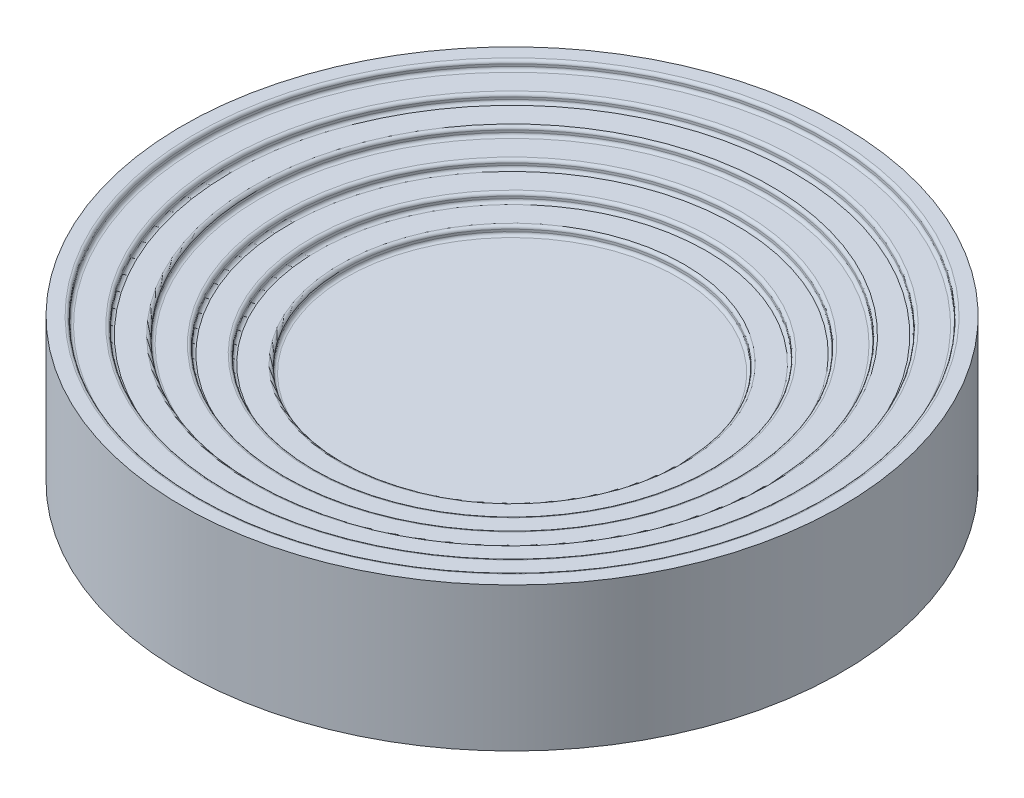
ISO-10303-21;
HEADER;
FILE_DESCRIPTION(('STEP AP214'),'2;1');
FILE_NAME('part.step','',(''),(''),'','','');
FILE_SCHEMA(('AUTOMOTIVE_DESIGN { 1 0 10303 214 1 1 1 1 }'));
ENDSEC;
DATA;
#1=APPLICATION_CONTEXT('core data for automotive mechanical design processes');
#2=APPLICATION_PROTOCOL_DEFINITION('international standard','automotive_design',2000,#1);
#3=PRODUCT_CONTEXT('',#1,'mechanical');
#4=PRODUCT('Part','Part','',(#3));
#5=PRODUCT_RELATED_PRODUCT_CATEGORY('part','',(#4));
#6=PRODUCT_DEFINITION_FORMATION('','',#4);
#7=PRODUCT_DEFINITION_CONTEXT('part definition',#1,'design');
#8=PRODUCT_DEFINITION('design','',#6,#7);
#9=PRODUCT_DEFINITION_SHAPE('','',#8);
#10=(LENGTH_UNIT() NAMED_UNIT(*) SI_UNIT(.MILLI.,.METRE.));
#11=(NAMED_UNIT(*) PLANE_ANGLE_UNIT() SI_UNIT($,.RADIAN.));
#12=(NAMED_UNIT(*) SI_UNIT($,.STERADIAN.) SOLID_ANGLE_UNIT());
#13=UNCERTAINTY_MEASURE_WITH_UNIT(LENGTH_MEASURE(1.E-05),#10,'distance_accuracy_value','');
#14=(GEOMETRIC_REPRESENTATION_CONTEXT(3) GLOBAL_UNCERTAINTY_ASSIGNED_CONTEXT((#13)) GLOBAL_UNIT_ASSIGNED_CONTEXT((#10,
#11,#12)) REPRESENTATION_CONTEXT('',''));
#15=CARTESIAN_POINT('',(0.,0.,0.));
#16=DIRECTION('',(0.,0.,1.));
#17=DIRECTION('',(1.,0.,0.));
#18=AXIS2_PLACEMENT_3D('',#15,#16,#17);
#19=CARTESIAN_POINT('',(0.,31.5,0.));
#20=DIRECTION('',(0.,1.,0.));
#21=DIRECTION('',(0.,0.,1.));
#22=AXIS2_PLACEMENT_3D('',#19,#20,#21);
#23=PLANE('',#22);
#24=CARTESIAN_POINT('',(0.,31.5,0.));
#25=DIRECTION('',(0.,1.,0.));
#26=DIRECTION('',(0.,0.,1.));
#27=AXIS2_PLACEMENT_3D('',#24,#25,#26);
#28=CIRCLE('',#27,55.375);
#29=CARTESIAN_POINT('',(0.,31.5,55.375));
#30=VERTEX_POINT('',#29);
#31=EDGE_CURVE('E108',#30,#30,#28,.T.);
#32=ORIENTED_EDGE('',*,*,#31,.T.);
#33=EDGE_LOOP('',(#32));
#34=FACE_BOUND('',#33,.T.);
#35=ADVANCED_FACE('F37',(#34),#23,.T.);
#36=CARTESIAN_POINT('',(0.,0.,0.));
#37=DIRECTION('',(0.,-1.,0.));
#38=DIRECTION('',(0.,0.,-1.));
#39=AXIS2_PLACEMENT_3D('',#36,#37,#38);
#40=CYLINDRICAL_SURFACE('',#39,56.375);
#41=CARTESIAN_POINT('',(0.,32.5,0.));
#42=DIRECTION('',(0.,1.,0.));
#43=DIRECTION('',(0.,0.,1.));
#44=AXIS2_PLACEMENT_3D('',#41,#42,#43);
#45=CIRCLE('',#44,56.375);
#46=CARTESIAN_POINT('',(0.,32.5,56.375));
#47=VERTEX_POINT('',#46);
#48=EDGE_CURVE('E111',#47,#47,#45,.F.);
#49=ORIENTED_EDGE('',*,*,#48,.T.);
#50=EDGE_LOOP('',(#49));
#51=FACE_BOUND('',#50,.T.);
#52=CARTESIAN_POINT('',(0.,33.25,0.));
#53=DIRECTION('',(0.,1.,0.));
#54=DIRECTION('',(0.,0.,1.));
#55=AXIS2_PLACEMENT_3D('',#52,#53,#54);
#56=CIRCLE('',#55,56.375);
#57=CARTESIAN_POINT('',(0.,33.25,56.375));
#58=VERTEX_POINT('',#57);
#59=EDGE_CURVE('E114',#58,#58,#56,.T.);
#60=ORIENTED_EDGE('',*,*,#59,.T.);
#61=EDGE_LOOP('',(#60));
#62=FACE_BOUND('',#61,.T.);
#63=ADVANCED_FACE('F156',(#51,#62),#40,.F.);
#64=CARTESIAN_POINT('',(56.375,34.25,0.));
#65=DIRECTION('',(0.,1.,0.));
#66=DIRECTION('',(0.,0.,1.));
#67=AXIS2_PLACEMENT_3D('',#64,#65,#66);
#68=PLANE('',#67);
#69=CARTESIAN_POINT('',(0.,34.25,0.));
#70=DIRECTION('',(0.,1.,0.));
#71=DIRECTION('',(0.,0.,1.));
#72=AXIS2_PLACEMENT_3D('',#69,#70,#71);
#73=CIRCLE('',#72,57.375);
#74=CARTESIAN_POINT('',(0.,34.25,57.375));
#75=VERTEX_POINT('',#74);
#76=EDGE_CURVE('E102',#75,#75,#73,.F.);
#77=ORIENTED_EDGE('',*,*,#76,.T.);
#78=EDGE_LOOP('',(#77));
#79=FACE_BOUND('',#78,.T.);
#80=CARTESIAN_POINT('',(0.,34.25,0.));
#81=DIRECTION('',(0.,1.,0.));
#82=DIRECTION('',(0.,0.,1.));
#83=AXIS2_PLACEMENT_3D('',#80,#81,#82);
#84=CIRCLE('',#83,65.);
#85=CARTESIAN_POINT('',(0.,34.25,65.));
#86=VERTEX_POINT('',#85);
#87=EDGE_CURVE('E105',#86,#86,#84,.T.);
#88=ORIENTED_EDGE('',*,*,#87,.T.);
#89=EDGE_LOOP('',(#88));
#90=FACE_BOUND('',#89,.T.);
#91=ADVANCED_FACE('F162',(#79,#90),#68,.T.);
#92=CARTESIAN_POINT('',(0.,0.,0.));
#93=DIRECTION('',(0.,-1.,0.));
#94=DIRECTION('',(0.,0.,-1.));
#95=AXIS2_PLACEMENT_3D('',#92,#93,#94);
#96=CYLINDRICAL_SURFACE('',#95,66.);
#97=CARTESIAN_POINT('',(0.,35.25,0.));
#98=DIRECTION('',(0.,1.,0.));
#99=DIRECTION('',(0.,0.,1.));
#100=AXIS2_PLACEMENT_3D('',#97,#98,#99);
#101=CIRCLE('',#100,66.);
#102=CARTESIAN_POINT('',(0.,35.25,66.));
#103=VERTEX_POINT('',#102);
#104=EDGE_CURVE('E96',#103,#103,#101,.F.);
#105=ORIENTED_EDGE('',*,*,#104,.T.);
#106=EDGE_LOOP('',(#105));
#107=FACE_BOUND('',#106,.T.);
#108=CARTESIAN_POINT('',(0.,36.,0.));
#109=DIRECTION('',(0.,1.,0.));
#110=DIRECTION('',(0.,0.,1.));
#111=AXIS2_PLACEMENT_3D('',#108,#109,#110);
#112=CIRCLE('',#111,66.);
#113=CARTESIAN_POINT('',(0.,36.,66.));
#114=VERTEX_POINT('',#113);
#115=EDGE_CURVE('E99',#114,#114,#112,.T.);
#116=ORIENTED_EDGE('',*,*,#115,.T.);
#117=EDGE_LOOP('',(#116));
#118=FACE_BOUND('',#117,.T.);
#119=ADVANCED_FACE('F247',(#107,#118),#96,.F.);
#120=CARTESIAN_POINT('',(66.,37.,0.));
#121=DIRECTION('',(0.,1.,0.));
#122=DIRECTION('',(0.,0.,1.));
#123=AXIS2_PLACEMENT_3D('',#120,#121,#122);
#124=PLANE('',#123);
#125=CARTESIAN_POINT('',(0.,37.,0.));
#126=DIRECTION('',(0.,1.,0.));
#127=DIRECTION('',(0.,0.,1.));
#128=AXIS2_PLACEMENT_3D('',#125,#126,#127);
#129=CIRCLE('',#128,67.);
#130=CARTESIAN_POINT('',(0.,37.,67.));
#131=VERTEX_POINT('',#130);
#132=EDGE_CURVE('E90',#131,#131,#129,.F.);
#133=ORIENTED_EDGE('',*,*,#132,.T.);
#134=EDGE_LOOP('',(#133));
#135=FACE_BOUND('',#134,.T.);
#136=CARTESIAN_POINT('',(0.,37.,0.));
#137=DIRECTION('',(0.,1.,0.));
#138=DIRECTION('',(0.,0.,1.));
#139=AXIS2_PLACEMENT_3D('',#136,#137,#138);
#140=CIRCLE('',#139,74.625);
#141=CARTESIAN_POINT('',(0.,37.,74.625));
#142=VERTEX_POINT('',#141);
#143=EDGE_CURVE('E93',#142,#142,#140,.T.);
#144=ORIENTED_EDGE('',*,*,#143,.T.);
#145=EDGE_LOOP('',(#144));
#146=FACE_BOUND('',#145,.T.);
#147=ADVANCED_FACE('F243',(#135,#146),#124,.T.);
#148=CARTESIAN_POINT('',(0.,0.,0.));
#149=DIRECTION('',(0.,-1.,0.));
#150=DIRECTION('',(0.,0.,-1.));
#151=AXIS2_PLACEMENT_3D('',#148,#149,#150);
#152=CYLINDRICAL_SURFACE('',#151,75.625);
#153=CARTESIAN_POINT('',(0.,38.,0.));
#154=DIRECTION('',(0.,1.,0.));
#155=DIRECTION('',(0.,0.,1.));
#156=AXIS2_PLACEMENT_3D('',#153,#154,#155);
#157=CIRCLE('',#156,75.625);
#158=CARTESIAN_POINT('',(0.,38.,75.625));
#159=VERTEX_POINT('',#158);
#160=EDGE_CURVE('E84',#159,#159,#157,.F.);
#161=ORIENTED_EDGE('',*,*,#160,.T.);
#162=EDGE_LOOP('',(#161));
#163=FACE_BOUND('',#162,.T.);
#164=CARTESIAN_POINT('',(0.,38.75,0.));
#165=DIRECTION('',(0.,1.,0.));
#166=DIRECTION('',(0.,0.,1.));
#167=AXIS2_PLACEMENT_3D('',#164,#165,#166);
#168=CIRCLE('',#167,75.625);
#169=CARTESIAN_POINT('',(0.,38.75,75.625));
#170=VERTEX_POINT('',#169);
#171=EDGE_CURVE('E87',#170,#170,#168,.T.);
#172=ORIENTED_EDGE('',*,*,#171,.T.);
#173=EDGE_LOOP('',(#172));
#174=FACE_BOUND('',#173,.T.);
#175=ADVANCED_FACE('F239',(#163,#174),#152,.F.);
#176=CARTESIAN_POINT('',(75.625,39.75,0.));
#177=DIRECTION('',(0.,1.,0.));
#178=DIRECTION('',(0.,0.,1.));
#179=AXIS2_PLACEMENT_3D('',#176,#177,#178);
#180=PLANE('',#179);
#181=CARTESIAN_POINT('',(0.,39.75,0.));
#182=DIRECTION('',(0.,1.,0.));
#183=DIRECTION('',(0.,0.,1.));
#184=AXIS2_PLACEMENT_3D('',#181,#182,#183);
#185=CIRCLE('',#184,76.625);
#186=CARTESIAN_POINT('',(0.,39.75,76.625));
#187=VERTEX_POINT('',#186);
#188=EDGE_CURVE('E78',#187,#187,#185,.F.);
#189=ORIENTED_EDGE('',*,*,#188,.T.);
#190=EDGE_LOOP('',(#189));
#191=FACE_BOUND('',#190,.T.);
#192=CARTESIAN_POINT('',(0.,39.75,0.));
#193=DIRECTION('',(0.,1.,0.));
#194=DIRECTION('',(0.,0.,1.));
#195=AXIS2_PLACEMENT_3D('',#192,#193,#194);
#196=CIRCLE('',#195,84.25);
#197=CARTESIAN_POINT('',(0.,39.75,84.25));
#198=VERTEX_POINT('',#197);
#199=EDGE_CURVE('E81',#198,#198,#196,.T.);
#200=ORIENTED_EDGE('',*,*,#199,.T.);
#201=EDGE_LOOP('',(#200));
#202=FACE_BOUND('',#201,.T.);
#203=ADVANCED_FACE('F235',(#191,#202),#180,.T.);
#204=CARTESIAN_POINT('',(0.,0.,0.));
#205=DIRECTION('',(0.,-1.,0.));
#206=DIRECTION('',(0.,0.,-1.));
#207=AXIS2_PLACEMENT_3D('',#204,#205,#206);
#208=CYLINDRICAL_SURFACE('',#207,85.25);
#209=CARTESIAN_POINT('',(0.,40.75,0.));
#210=DIRECTION('',(0.,1.,0.));
#211=DIRECTION('',(0.,0.,1.));
#212=AXIS2_PLACEMENT_3D('',#209,#210,#211);
#213=CIRCLE('',#212,85.25);
#214=CARTESIAN_POINT('',(0.,40.75,85.25));
#215=VERTEX_POINT('',#214);
#216=EDGE_CURVE('E72',#215,#215,#213,.F.);
#217=ORIENTED_EDGE('',*,*,#216,.T.);
#218=EDGE_LOOP('',(#217));
#219=FACE_BOUND('',#218,.T.);
#220=CARTESIAN_POINT('',(0.,41.5,0.));
#221=DIRECTION('',(0.,1.,0.));
#222=DIRECTION('',(0.,0.,1.));
#223=AXIS2_PLACEMENT_3D('',#220,#221,#222);
#224=CIRCLE('',#223,85.25);
#225=CARTESIAN_POINT('',(0.,41.5,85.25));
#226=VERTEX_POINT('',#225);
#227=EDGE_CURVE('E75',#226,#226,#224,.T.);
#228=ORIENTED_EDGE('',*,*,#227,.T.);
#229=EDGE_LOOP('',(#228));
#230=FACE_BOUND('',#229,.T.);
#231=ADVANCED_FACE('F231',(#219,#230),#208,.F.);
#232=CARTESIAN_POINT('',(85.25,42.5,0.));
#233=DIRECTION('',(0.,1.,0.));
#234=DIRECTION('',(0.,0.,1.));
#235=AXIS2_PLACEMENT_3D('',#232,#233,#234);
#236=PLANE('',#235);
#237=CARTESIAN_POINT('',(0.,42.5,0.));
#238=DIRECTION('',(0.,1.,0.));
#239=DIRECTION('',(0.,0.,1.));
#240=AXIS2_PLACEMENT_3D('',#237,#238,#239);
#241=CIRCLE('',#240,86.25);
#242=CARTESIAN_POINT('',(0.,42.5,86.25));
#243=VERTEX_POINT('',#242);
#244=EDGE_CURVE('E66',#243,#243,#241,.F.);
#245=ORIENTED_EDGE('',*,*,#244,.T.);
#246=EDGE_LOOP('',(#245));
#247=FACE_BOUND('',#246,.T.);
#248=CARTESIAN_POINT('',(0.,42.5,0.));
#249=DIRECTION('',(0.,1.,0.));
#250=DIRECTION('',(0.,0.,1.));
#251=AXIS2_PLACEMENT_3D('',#248,#249,#250);
#252=CIRCLE('',#251,93.875);
#253=CARTESIAN_POINT('',(0.,42.5,93.875));
#254=VERTEX_POINT('',#253);
#255=EDGE_CURVE('E69',#254,#254,#252,.T.);
#256=ORIENTED_EDGE('',*,*,#255,.T.);
#257=EDGE_LOOP('',(#256));
#258=FACE_BOUND('',#257,.T.);
#259=ADVANCED_FACE('F225',(#247,#258),#236,.T.);
#260=CARTESIAN_POINT('',(0.,0.,0.));
#261=DIRECTION('',(0.,-1.,0.));
#262=DIRECTION('',(0.,0.,-1.));
#263=AXIS2_PLACEMENT_3D('',#260,#261,#262);
#264=CYLINDRICAL_SURFACE('',#263,94.875);
#265=CARTESIAN_POINT('',(0.,43.5,0.));
#266=DIRECTION('',(0.,1.,0.));
#267=DIRECTION('',(0.,0.,1.));
#268=AXIS2_PLACEMENT_3D('',#265,#266,#267);
#269=CIRCLE('',#268,94.875);
#270=CARTESIAN_POINT('',(0.,43.5,94.875));
#271=VERTEX_POINT('',#270);
#272=EDGE_CURVE('E60',#271,#271,#269,.F.);
#273=ORIENTED_EDGE('',*,*,#272,.T.);
#274=EDGE_LOOP('',(#273));
#275=FACE_BOUND('',#274,.T.);
#276=CARTESIAN_POINT('',(0.,44.25,0.));
#277=DIRECTION('',(0.,1.,0.));
#278=DIRECTION('',(0.,0.,1.));
#279=AXIS2_PLACEMENT_3D('',#276,#277,#278);
#280=CIRCLE('',#279,94.875);
#281=CARTESIAN_POINT('',(0.,44.25,94.875));
#282=VERTEX_POINT('',#281);
#283=EDGE_CURVE('E63',#282,#282,#280,.T.);
#284=ORIENTED_EDGE('',*,*,#283,.T.);
#285=EDGE_LOOP('',(#284));
#286=FACE_BOUND('',#285,.T.);
#287=ADVANCED_FACE('F217',(#275,#286),#264,.F.);
#288=CARTESIAN_POINT('',(94.875,45.25,0.));
#289=DIRECTION('',(0.,1.,0.));
#290=DIRECTION('',(0.,0.,1.));
#291=AXIS2_PLACEMENT_3D('',#288,#289,#290);
#292=PLANE('',#291);
#293=CARTESIAN_POINT('',(0.,45.25,0.));
#294=DIRECTION('',(0.,1.,0.));
#295=DIRECTION('',(0.,0.,1.));
#296=AXIS2_PLACEMENT_3D('',#293,#294,#295);
#297=CIRCLE('',#296,95.875);
#298=CARTESIAN_POINT('',(0.,45.25,95.875));
#299=VERTEX_POINT('',#298);
#300=EDGE_CURVE('E52',#299,#299,#297,.F.);
#301=ORIENTED_EDGE('',*,*,#300,.T.);
#302=EDGE_LOOP('',(#301));
#303=FACE_BOUND('',#302,.T.);
#304=CARTESIAN_POINT('',(0.,45.25,0.));
#305=DIRECTION('',(0.,1.,0.));
#306=DIRECTION('',(0.,0.,1.));
#307=AXIS2_PLACEMENT_3D('',#304,#305,#306);
#308=CIRCLE('',#307,103.5);
#309=CARTESIAN_POINT('',(0.,45.25,103.5));
#310=VERTEX_POINT('',#309);
#311=EDGE_CURVE('E57',#310,#310,#308,.T.);
#312=ORIENTED_EDGE('',*,*,#311,.T.);
#313=EDGE_LOOP('',(#312));
#314=FACE_BOUND('',#313,.T.);
#315=ADVANCED_FACE('F215',(#303,#314),#292,.T.);
#316=CARTESIAN_POINT('',(0.,0.,0.));
#317=DIRECTION('',(0.,-1.,0.));
#318=DIRECTION('',(0.,0.,-1.));
#319=AXIS2_PLACEMENT_3D('',#316,#317,#318);
#320=CYLINDRICAL_SURFACE('',#319,104.5);
#321=CARTESIAN_POINT('',(0.,46.25,0.));
#322=DIRECTION('',(0.,1.,0.));
#323=DIRECTION('',(0.,0.,1.));
#324=AXIS2_PLACEMENT_3D('',#321,#322,#323);
#325=CIRCLE('',#324,104.5);
#326=CARTESIAN_POINT('',(0.,46.25,104.5));
#327=VERTEX_POINT('',#326);
#328=EDGE_CURVE('E44',#327,#327,#325,.F.);
#329=ORIENTED_EDGE('',*,*,#328,.T.);
#330=EDGE_LOOP('',(#329));
#331=FACE_BOUND('',#330,.T.);
#332=CARTESIAN_POINT('',(0.,47.,0.));
#333=DIRECTION('',(0.,1.,0.));
#334=DIRECTION('',(0.,0.,1.));
#335=AXIS2_PLACEMENT_3D('',#332,#333,#334);
#336=CIRCLE('',#335,104.5);
#337=CARTESIAN_POINT('',(0.,47.,104.5));
#338=VERTEX_POINT('',#337);
#339=EDGE_CURVE('E48',#338,#338,#336,.T.);
#340=ORIENTED_EDGE('',*,*,#339,.T.);
#341=EDGE_LOOP('',(#340));
#342=FACE_BOUND('',#341,.T.);
#343=ADVANCED_FACE('F154',(#331,#342),#320,.F.);
#344=CARTESIAN_POINT('',(110.,48.,0.));
#345=DIRECTION('',(0.,1.,0.));
#346=DIRECTION('',(0.,0.,1.));
#347=AXIS2_PLACEMENT_3D('',#344,#345,#346);
#348=PLANE('',#347);
#349=CARTESIAN_POINT('',(0.,48.,0.));
#350=DIRECTION('',(0.,1.,0.));
#351=DIRECTION('',(0.,0.,1.));
#352=AXIS2_PLACEMENT_3D('',#349,#350,#351);
#353=CIRCLE('',#352,105.5);
#354=CARTESIAN_POINT('',(0.,48.,105.5));
#355=VERTEX_POINT('',#354);
#356=EDGE_CURVE('E10',#355,#355,#353,.F.);
#357=ORIENTED_EDGE('',*,*,#356,.T.);
#358=EDGE_LOOP('',(#357));
#359=FACE_BOUND('',#358,.T.);
#360=CARTESIAN_POINT('',(0.,48.,0.));
#361=DIRECTION('',(0.,-1.,0.));
#362=DIRECTION('',(0.,0.,-1.));
#363=AXIS2_PLACEMENT_3D('',#360,#361,#362);
#364=CIRCLE('',#363,110.);
#365=CARTESIAN_POINT('',(0.,48.,-110.));
#366=VERTEX_POINT('',#365);
#367=EDGE_CURVE('E117',#366,#366,#364,.T.);
#368=ORIENTED_EDGE('',*,*,#367,.F.);
#369=EDGE_LOOP('',(#368));
#370=FACE_BOUND('',#369,.T.);
#371=ADVANCED_FACE('F147',(#359,#370),#348,.T.);
#372=CARTESIAN_POINT('',(0.,0.,0.));
#373=DIRECTION('',(0.,-1.,0.));
#374=DIRECTION('',(0.,0.,-1.));
#375=AXIS2_PLACEMENT_3D('',#372,#373,#374);
#376=CYLINDRICAL_SURFACE('',#375,110.);
#377=ORIENTED_EDGE('',*,*,#367,.T.);
#378=EDGE_LOOP('',(#377));
#379=FACE_BOUND('',#378,.T.);
#380=CARTESIAN_POINT('',(0.,0.,0.));
#381=DIRECTION('',(0.,-1.,0.));
#382=DIRECTION('',(0.,0.,-1.));
#383=AXIS2_PLACEMENT_3D('',#380,#381,#382);
#384=CIRCLE('',#383,110.);
#385=CARTESIAN_POINT('',(0.,0.,-110.));
#386=VERTEX_POINT('',#385);
#387=EDGE_CURVE('E120',#386,#386,#384,.T.);
#388=ORIENTED_EDGE('',*,*,#387,.F.);
#389=EDGE_LOOP('',(#388));
#390=FACE_BOUND('',#389,.T.);
#391=ADVANCED_FACE('F142',(#379,#390),#376,.T.);
#392=CARTESIAN_POINT('',(0.,0.,0.));
#393=DIRECTION('',(0.,-1.,0.));
#394=DIRECTION('',(0.,0.,-1.));
#395=AXIS2_PLACEMENT_3D('',#392,#393,#394);
#396=PLANE('',#395);
#397=CARTESIAN_POINT('',(0.,0.,0.));
#398=DIRECTION('',(0.,-1.,0.));
#399=DIRECTION('',(0.,0.,-1.));
#400=AXIS2_PLACEMENT_3D('',#397,#398,#399);
#401=CIRCLE('',#400,102.);
#402=CARTESIAN_POINT('',(0.,0.,-102.));
#403=VERTEX_POINT('',#402);
#404=EDGE_CURVE('E124',#403,#403,#401,.T.);
#405=ORIENTED_EDGE('',*,*,#404,.F.);
#406=EDGE_LOOP('',(#405));
#407=FACE_BOUND('',#406,.T.);
#408=ORIENTED_EDGE('',*,*,#387,.T.);
#409=EDGE_LOOP('',(#408));
#410=FACE_BOUND('',#409,.T.);
#411=ADVANCED_FACE('F138',(#407,#410),#396,.T.);
#412=CARTESIAN_POINT('',(0.,32.5,0.));
#413=DIRECTION('',(0.,1.,0.));
#414=DIRECTION('',(0.,0.,1.));
#415=AXIS2_PLACEMENT_3D('',#412,#413,#414);
#416=TOROIDAL_SURFACE('',#415,55.375,1.);
#417=ORIENTED_EDGE('',*,*,#31,.F.);
#418=EDGE_LOOP('',(#417));
#419=FACE_BOUND('',#418,.T.);
#420=ORIENTED_EDGE('',*,*,#48,.F.);
#421=EDGE_LOOP('',(#420));
#422=FACE_BOUND('',#421,.T.);
#423=ADVANCED_FACE('F141',(#419,#422),#416,.F.);
#424=CARTESIAN_POINT('',(0.,33.25,0.));
#425=DIRECTION('',(0.,1.,0.));
#426=DIRECTION('',(0.,0.,1.));
#427=AXIS2_PLACEMENT_3D('',#424,#425,#426);
#428=TOROIDAL_SURFACE('',#427,57.375,1.);
#429=ORIENTED_EDGE('',*,*,#59,.F.);
#430=EDGE_LOOP('',(#429));
#431=FACE_BOUND('',#430,.T.);
#432=ORIENTED_EDGE('',*,*,#76,.F.);
#433=EDGE_LOOP('',(#432));
#434=FACE_BOUND('',#433,.T.);
#435=ADVANCED_FACE('F169',(#431,#434),#428,.T.);
#436=CARTESIAN_POINT('',(0.,35.25,0.));
#437=DIRECTION('',(0.,1.,0.));
#438=DIRECTION('',(0.,0.,1.));
#439=AXIS2_PLACEMENT_3D('',#436,#437,#438);
#440=TOROIDAL_SURFACE('',#439,65.,1.);
#441=ORIENTED_EDGE('',*,*,#87,.F.);
#442=EDGE_LOOP('',(#441));
#443=FACE_BOUND('',#442,.T.);
#444=ORIENTED_EDGE('',*,*,#104,.F.);
#445=EDGE_LOOP('',(#444));
#446=FACE_BOUND('',#445,.T.);
#447=ADVANCED_FACE('F173',(#443,#446),#440,.F.);
#448=CARTESIAN_POINT('',(0.,36.,0.));
#449=DIRECTION('',(0.,1.,0.));
#450=DIRECTION('',(0.,0.,1.));
#451=AXIS2_PLACEMENT_3D('',#448,#449,#450);
#452=TOROIDAL_SURFACE('',#451,67.,1.);
#453=ORIENTED_EDGE('',*,*,#115,.F.);
#454=EDGE_LOOP('',(#453));
#455=FACE_BOUND('',#454,.T.);
#456=ORIENTED_EDGE('',*,*,#132,.F.);
#457=EDGE_LOOP('',(#456));
#458=FACE_BOUND('',#457,.T.);
#459=ADVANCED_FACE('F177',(#455,#458),#452,.T.);
#460=CARTESIAN_POINT('',(0.,38.,0.));
#461=DIRECTION('',(0.,1.,0.));
#462=DIRECTION('',(0.,0.,1.));
#463=AXIS2_PLACEMENT_3D('',#460,#461,#462);
#464=TOROIDAL_SURFACE('',#463,74.625,1.);
#465=ORIENTED_EDGE('',*,*,#143,.F.);
#466=EDGE_LOOP('',(#465));
#467=FACE_BOUND('',#466,.T.);
#468=ORIENTED_EDGE('',*,*,#160,.F.);
#469=EDGE_LOOP('',(#468));
#470=FACE_BOUND('',#469,.T.);
#471=ADVANCED_FACE('F181',(#467,#470),#464,.F.);
#472=CARTESIAN_POINT('',(0.,38.75,0.));
#473=DIRECTION('',(0.,1.,0.));
#474=DIRECTION('',(0.,0.,1.));
#475=AXIS2_PLACEMENT_3D('',#472,#473,#474);
#476=TOROIDAL_SURFACE('',#475,76.625,1.);
#477=ORIENTED_EDGE('',*,*,#171,.F.);
#478=EDGE_LOOP('',(#477));
#479=FACE_BOUND('',#478,.T.);
#480=ORIENTED_EDGE('',*,*,#188,.F.);
#481=EDGE_LOOP('',(#480));
#482=FACE_BOUND('',#481,.T.);
#483=ADVANCED_FACE('F185',(#479,#482),#476,.T.);
#484=CARTESIAN_POINT('',(0.,40.75,0.));
#485=DIRECTION('',(0.,1.,0.));
#486=DIRECTION('',(0.,0.,1.));
#487=AXIS2_PLACEMENT_3D('',#484,#485,#486);
#488=TOROIDAL_SURFACE('',#487,84.25,1.);
#489=ORIENTED_EDGE('',*,*,#199,.F.);
#490=EDGE_LOOP('',(#489));
#491=FACE_BOUND('',#490,.T.);
#492=ORIENTED_EDGE('',*,*,#216,.F.);
#493=EDGE_LOOP('',(#492));
#494=FACE_BOUND('',#493,.T.);
#495=ADVANCED_FACE('F189',(#491,#494),#488,.F.);
#496=CARTESIAN_POINT('',(0.,41.5,0.));
#497=DIRECTION('',(0.,1.,0.));
#498=DIRECTION('',(0.,0.,1.));
#499=AXIS2_PLACEMENT_3D('',#496,#497,#498);
#500=TOROIDAL_SURFACE('',#499,86.25,1.);
#501=ORIENTED_EDGE('',*,*,#227,.F.);
#502=EDGE_LOOP('',(#501));
#503=FACE_BOUND('',#502,.T.);
#504=ORIENTED_EDGE('',*,*,#244,.F.);
#505=EDGE_LOOP('',(#504));
#506=FACE_BOUND('',#505,.T.);
#507=ADVANCED_FACE('F193',(#503,#506),#500,.T.);
#508=CARTESIAN_POINT('',(0.,43.5,0.));
#509=DIRECTION('',(0.,1.,0.));
#510=DIRECTION('',(0.,0.,1.));
#511=AXIS2_PLACEMENT_3D('',#508,#509,#510);
#512=TOROIDAL_SURFACE('',#511,93.875,1.);
#513=ORIENTED_EDGE('',*,*,#255,.F.);
#514=EDGE_LOOP('',(#513));
#515=FACE_BOUND('',#514,.T.);
#516=ORIENTED_EDGE('',*,*,#272,.F.);
#517=EDGE_LOOP('',(#516));
#518=FACE_BOUND('',#517,.T.);
#519=ADVANCED_FACE('F197',(#515,#518),#512,.F.);
#520=CARTESIAN_POINT('',(0.,44.25,0.));
#521=DIRECTION('',(0.,1.,0.));
#522=DIRECTION('',(0.,0.,1.));
#523=AXIS2_PLACEMENT_3D('',#520,#521,#522);
#524=TOROIDAL_SURFACE('',#523,95.875,1.);
#525=ORIENTED_EDGE('',*,*,#283,.F.);
#526=EDGE_LOOP('',(#525));
#527=FACE_BOUND('',#526,.T.);
#528=ORIENTED_EDGE('',*,*,#300,.F.);
#529=EDGE_LOOP('',(#528));
#530=FACE_BOUND('',#529,.T.);
#531=ADVANCED_FACE('F201',(#527,#530),#524,.T.);
#532=CARTESIAN_POINT('',(0.,46.25,0.));
#533=DIRECTION('',(0.,1.,0.));
#534=DIRECTION('',(0.,0.,1.));
#535=AXIS2_PLACEMENT_3D('',#532,#533,#534);
#536=TOROIDAL_SURFACE('',#535,103.5,1.);
#537=ORIENTED_EDGE('',*,*,#311,.F.);
#538=EDGE_LOOP('',(#537));
#539=FACE_BOUND('',#538,.T.);
#540=ORIENTED_EDGE('',*,*,#328,.F.);
#541=EDGE_LOOP('',(#540));
#542=FACE_BOUND('',#541,.T.);
#543=ADVANCED_FACE('F204',(#539,#542),#536,.F.);
#544=CARTESIAN_POINT('',(0.,47.,0.));
#545=DIRECTION('',(0.,1.,0.));
#546=DIRECTION('',(0.,0.,1.));
#547=AXIS2_PLACEMENT_3D('',#544,#545,#546);
#548=TOROIDAL_SURFACE('',#547,105.5,1.);
#549=ORIENTED_EDGE('',*,*,#339,.F.);
#550=EDGE_LOOP('',(#549));
#551=FACE_BOUND('',#550,.T.);
#552=ORIENTED_EDGE('',*,*,#356,.F.);
#553=EDGE_LOOP('',(#552));
#554=FACE_BOUND('',#553,.T.);
#555=ADVANCED_FACE('F39',(#551,#554),#548,.T.);
#556=CARTESIAN_POINT('',(0.,27.,0.));
#557=DIRECTION('',(0.,-1.,0.));
#558=DIRECTION('',(0.,0.,-1.));
#559=AXIS2_PLACEMENT_3D('',#556,#557,#558);
#560=CYLINDRICAL_SURFACE('',#559,102.);
#561=CARTESIAN_POINT('',(0.,27.,0.));
#562=DIRECTION('',(0.,-1.,0.));
#563=DIRECTION('',(0.,0.,-1.));
#564=AXIS2_PLACEMENT_3D('',#561,#562,#563);
#565=CIRCLE('',#564,102.);
#566=CARTESIAN_POINT('',(0.,27.,-102.));
#567=VERTEX_POINT('',#566);
#568=EDGE_CURVE('E123',#567,#567,#565,.T.);
#569=ORIENTED_EDGE('',*,*,#568,.F.);
#570=EDGE_LOOP('',(#569));
#571=FACE_BOUND('',#570,.T.);
#572=ORIENTED_EDGE('',*,*,#404,.T.);
#573=EDGE_LOOP('',(#572));
#574=FACE_BOUND('',#573,.T.);
#575=ADVANCED_FACE('F132',(#571,#574),#560,.F.);
#576=CARTESIAN_POINT('',(0.,27.,0.));
#577=DIRECTION('',(0.,-1.,0.));
#578=DIRECTION('',(0.,0.,-1.));
#579=AXIS2_PLACEMENT_3D('',#576,#577,#578);
#580=PLANE('',#579);
#581=ORIENTED_EDGE('',*,*,#568,.T.);
#582=EDGE_LOOP('',(#581));
#583=FACE_BOUND('',#582,.T.);
#584=ADVANCED_FACE('F130',(#583),#580,.T.);
#585=CLOSED_SHELL('',(#35,#63,#91,#119,#147,#175,#203,#231,#259,#287,#315,#343,#371,#391,#411,
#423,#435,#447,#459,#471,#483,#495,#507,#519,#531,#543,#555,#575,#584));
#586=MANIFOLD_SOLID_BREP('B2',#585);
#587=ADVANCED_BREP_SHAPE_REPRESENTATION('',(#18,#586),#14);
#588=SHAPE_DEFINITION_REPRESENTATION(#9,#587);
ENDSEC;
END-ISO-10303-21;
